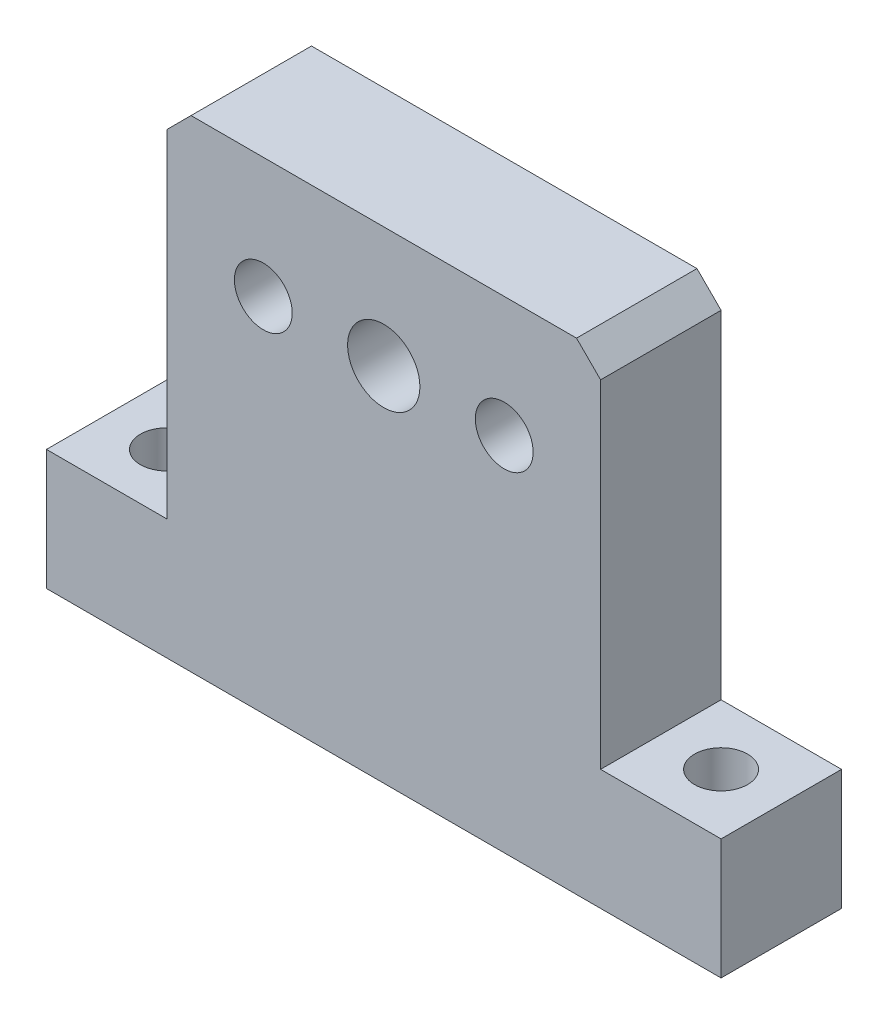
ISO-10303-21;
HEADER;
FILE_DESCRIPTION(('STEP AP214'),'2;1');
FILE_NAME('part.step','',(''),(''),'','','');
FILE_SCHEMA(('AUTOMOTIVE_DESIGN { 1 0 10303 214 1 1 1 1 }'));
ENDSEC;
DATA;
#1=APPLICATION_CONTEXT('core data for automotive mechanical design processes');
#2=APPLICATION_PROTOCOL_DEFINITION('international standard','automotive_design',2000,#1);
#3=PRODUCT_CONTEXT('',#1,'mechanical');
#4=PRODUCT('Part','Part','',(#3));
#5=PRODUCT_RELATED_PRODUCT_CATEGORY('part','',(#4));
#6=PRODUCT_DEFINITION_FORMATION('','',#4);
#7=PRODUCT_DEFINITION_CONTEXT('part definition',#1,'design');
#8=PRODUCT_DEFINITION('design','',#6,#7);
#9=PRODUCT_DEFINITION_SHAPE('','',#8);
#10=(LENGTH_UNIT() NAMED_UNIT(*) SI_UNIT(.MILLI.,.METRE.));
#11=(NAMED_UNIT(*) PLANE_ANGLE_UNIT() SI_UNIT($,.RADIAN.));
#12=(NAMED_UNIT(*) SI_UNIT($,.STERADIAN.) SOLID_ANGLE_UNIT());
#13=UNCERTAINTY_MEASURE_WITH_UNIT(LENGTH_MEASURE(1.E-05),#10,'distance_accuracy_value','');
#14=(GEOMETRIC_REPRESENTATION_CONTEXT(3) GLOBAL_UNCERTAINTY_ASSIGNED_CONTEXT((#13)) GLOBAL_UNIT_ASSIGNED_CONTEXT((#10,
#11,#12)) REPRESENTATION_CONTEXT('',''));
#15=CARTESIAN_POINT('',(0.,0.,0.));
#16=DIRECTION('',(0.,0.,1.));
#17=DIRECTION('',(1.,0.,0.));
#18=AXIS2_PLACEMENT_3D('',#15,#16,#17);
#19=CARTESIAN_POINT('',(-70.,100.,25.));
#20=DIRECTION('',(1.,0.,0.));
#21=DIRECTION('',(0.,1.,0.));
#22=AXIS2_PLACEMENT_3D('',#19,#20,#21);
#23=PLANE('',#22);
#24=DIRECTION('',(0.,-1.,0.));
#25=VECTOR('',#24,1.);
#26=CARTESIAN_POINT('',(-70.,100.,25.));
#27=LINE('',#26,#25);
#28=CARTESIAN_POINT('',(-70.,25.,25.));
#29=VERTEX_POINT('',#28);
#30=CARTESIAN_POINT('',(-70.,0.,25.));
#31=VERTEX_POINT('',#30);
#32=EDGE_CURVE('E137',#29,#31,#27,.T.);
#33=ORIENTED_EDGE('',*,*,#32,.F.);
#34=DIRECTION('',(0.,0.,1.));
#35=VECTOR('',#34,1.);
#36=CARTESIAN_POINT('',(-70.,25.,0.));
#37=LINE('',#36,#35);
#38=CARTESIAN_POINT('',(-70.,25.,0.));
#39=VERTEX_POINT('',#38);
#40=EDGE_CURVE('E187',#39,#29,#37,.T.);
#41=ORIENTED_EDGE('',*,*,#40,.F.);
#42=DIRECTION('',(0.,-1.,0.));
#43=VECTOR('',#42,1.);
#44=CARTESIAN_POINT('',(-70.,100.,0.));
#45=LINE('',#44,#43);
#46=CARTESIAN_POINT('',(-70.,0.,0.));
#47=VERTEX_POINT('',#46);
#48=EDGE_CURVE('E139',#39,#47,#45,.T.);
#49=ORIENTED_EDGE('',*,*,#48,.T.);
#50=DIRECTION('',(0.,0.,-1.));
#51=VECTOR('',#50,1.);
#52=CARTESIAN_POINT('',(-70.,0.,25.));
#53=LINE('',#52,#51);
#54=EDGE_CURVE('E144',#31,#47,#53,.T.);
#55=ORIENTED_EDGE('',*,*,#54,.F.);
#56=EDGE_LOOP('',(#33,#41,#49,#55));
#57=FACE_BOUND('',#56,.T.);
#58=ADVANCED_FACE('F31',(#57),#23,.F.);
#59=CARTESIAN_POINT('',(-70.,0.,25.));
#60=DIRECTION('',(0.,1.,0.));
#61=DIRECTION('',(0.,0.,1.));
#62=AXIS2_PLACEMENT_3D('',#59,#60,#61);
#63=PLANE('',#62);
#64=CARTESIAN_POINT('',(57.5,0.,12.5));
#65=DIRECTION('',(0.,1.,0.));
#66=DIRECTION('',(0.,0.,1.));
#67=AXIS2_PLACEMENT_3D('',#64,#65,#66);
#68=CIRCLE('',#67,5.5);
#69=CARTESIAN_POINT('',(57.5,0.,18.));
#70=VERTEX_POINT('',#69);
#71=EDGE_CURVE('E268',#70,#70,#68,.T.);
#72=ORIENTED_EDGE('',*,*,#71,.T.);
#73=EDGE_LOOP('',(#72));
#74=FACE_BOUND('',#73,.T.);
#75=CARTESIAN_POINT('',(-57.5,0.,12.5));
#76=DIRECTION('',(0.,1.,0.));
#77=DIRECTION('',(0.,0.,1.));
#78=AXIS2_PLACEMENT_3D('',#75,#76,#77);
#79=CIRCLE('',#78,5.5);
#80=CARTESIAN_POINT('',(-57.5,0.,18.));
#81=VERTEX_POINT('',#80);
#82=EDGE_CURVE('E276',#81,#81,#79,.T.);
#83=ORIENTED_EDGE('',*,*,#82,.T.);
#84=EDGE_LOOP('',(#83));
#85=FACE_BOUND('',#84,.T.);
#86=DIRECTION('',(1.,0.,0.));
#87=VECTOR('',#86,1.);
#88=CARTESIAN_POINT('',(-70.,0.,0.));
#89=LINE('',#88,#87);
#90=CARTESIAN_POINT('',(70.,0.,0.));
#91=VERTEX_POINT('',#90);
#92=EDGE_CURVE('E135',#47,#91,#89,.T.);
#93=ORIENTED_EDGE('',*,*,#92,.T.);
#94=DIRECTION('',(0.,0.,-1.));
#95=VECTOR('',#94,1.);
#96=CARTESIAN_POINT('',(70.,0.,25.));
#97=LINE('',#96,#95);
#98=CARTESIAN_POINT('',(70.,0.,25.));
#99=VERTEX_POINT('',#98);
#100=EDGE_CURVE('E133',#99,#91,#97,.T.);
#101=ORIENTED_EDGE('',*,*,#100,.F.);
#102=DIRECTION('',(1.,0.,0.));
#103=VECTOR('',#102,1.);
#104=CARTESIAN_POINT('',(-70.,0.,25.));
#105=LINE('',#104,#103);
#106=EDGE_CURVE('E179',#31,#99,#105,.T.);
#107=ORIENTED_EDGE('',*,*,#106,.F.);
#108=ORIENTED_EDGE('',*,*,#54,.T.);
#109=EDGE_LOOP('',(#93,#101,#107,#108));
#110=FACE_BOUND('',#109,.T.);
#111=ADVANCED_FACE('F201',(#74,#85,#110),#63,.F.);
#112=CARTESIAN_POINT('',(70.,100.,25.));
#113=DIRECTION('',(-1.,0.,0.));
#114=DIRECTION('',(0.,-1.,0.));
#115=AXIS2_PLACEMENT_3D('',#112,#113,#114);
#116=PLANE('',#115);
#117=DIRECTION('',(0.,1.,0.));
#118=VECTOR('',#117,1.);
#119=CARTESIAN_POINT('',(70.,100.,0.));
#120=LINE('',#119,#118);
#121=CARTESIAN_POINT('',(70.,25.,0.));
#122=VERTEX_POINT('',#121);
#123=EDGE_CURVE('E126',#91,#122,#120,.T.);
#124=ORIENTED_EDGE('',*,*,#123,.T.);
#125=DIRECTION('',(0.,0.,1.));
#126=VECTOR('',#125,1.);
#127=CARTESIAN_POINT('',(70.,25.,0.));
#128=LINE('',#127,#126);
#129=CARTESIAN_POINT('',(70.,25.,25.));
#130=VERTEX_POINT('',#129);
#131=EDGE_CURVE('E108',#122,#130,#128,.T.);
#132=ORIENTED_EDGE('',*,*,#131,.T.);
#133=DIRECTION('',(0.,1.,0.));
#134=VECTOR('',#133,1.);
#135=CARTESIAN_POINT('',(70.,100.,25.));
#136=LINE('',#135,#134);
#137=EDGE_CURVE('E177',#99,#130,#136,.T.);
#138=ORIENTED_EDGE('',*,*,#137,.F.);
#139=ORIENTED_EDGE('',*,*,#100,.T.);
#140=EDGE_LOOP('',(#124,#132,#138,#139));
#141=FACE_BOUND('',#140,.T.);
#142=ADVANCED_FACE('F131',(#141),#116,.F.);
#143=CARTESIAN_POINT('',(-70.,100.,25.));
#144=DIRECTION('',(0.,-1.,0.));
#145=DIRECTION('',(0.,0.,-1.));
#146=AXIS2_PLACEMENT_3D('',#143,#144,#145);
#147=PLANE('',#146);
#148=DIRECTION('',(-1.,0.,0.));
#149=VECTOR('',#148,1.);
#150=CARTESIAN_POINT('',(-70.,100.,25.));
#151=LINE('',#150,#149);
#152=CARTESIAN_POINT('',(40.,100.,25.));
#153=VERTEX_POINT('',#152);
#154=CARTESIAN_POINT('',(-40.,100.,25.));
#155=VERTEX_POINT('',#154);
#156=EDGE_CURVE('E145',#153,#155,#151,.T.);
#157=ORIENTED_EDGE('',*,*,#156,.F.);
#158=DIRECTION('',(0.,0.,-1.));
#159=VECTOR('',#158,1.);
#160=CARTESIAN_POINT('',(40.,100.,25.));
#161=LINE('',#160,#159);
#162=CARTESIAN_POINT('',(40.,100.,0.));
#163=VERTEX_POINT('',#162);
#164=EDGE_CURVE('E158',#153,#163,#161,.T.);
#165=ORIENTED_EDGE('',*,*,#164,.T.);
#166=DIRECTION('',(-1.,0.,0.));
#167=VECTOR('',#166,1.);
#168=CARTESIAN_POINT('',(-70.,100.,0.));
#169=LINE('',#168,#167);
#170=CARTESIAN_POINT('',(-40.,100.,0.));
#171=VERTEX_POINT('',#170);
#172=EDGE_CURVE('E134',#163,#171,#169,.T.);
#173=ORIENTED_EDGE('',*,*,#172,.T.);
#174=DIRECTION('',(0.,0.,1.));
#175=VECTOR('',#174,1.);
#176=CARTESIAN_POINT('',(-40.,100.,25.));
#177=LINE('',#176,#175);
#178=EDGE_CURVE('E155',#171,#155,#177,.T.);
#179=ORIENTED_EDGE('',*,*,#178,.T.);
#180=EDGE_LOOP('',(#157,#165,#173,#179));
#181=FACE_BOUND('',#180,.T.);
#182=ADVANCED_FACE('F175',(#181),#147,.F.);
#183=CARTESIAN_POINT('',(-70.,0.,25.));
#184=DIRECTION('',(0.,0.,1.));
#185=DIRECTION('',(1.,0.,0.));
#186=AXIS2_PLACEMENT_3D('',#183,#184,#185);
#187=PLANE('',#186);
#188=CARTESIAN_POINT('',(25.,75.,25.));
#189=DIRECTION('',(0.,0.,1.));
#190=DIRECTION('',(1.,0.,0.));
#191=AXIS2_PLACEMENT_3D('',#188,#189,#190);
#192=CIRCLE('',#191,6.);
#193=CARTESIAN_POINT('',(31.,75.,25.));
#194=VERTEX_POINT('',#193);
#195=EDGE_CURVE('E279',#194,#194,#192,.T.);
#196=ORIENTED_EDGE('',*,*,#195,.F.);
#197=EDGE_LOOP('',(#196));
#198=FACE_BOUND('',#197,.T.);
#199=CARTESIAN_POINT('',(-25.,75.,25.));
#200=DIRECTION('',(0.,0.,1.));
#201=DIRECTION('',(1.,0.,0.));
#202=AXIS2_PLACEMENT_3D('',#199,#200,#201);
#203=CIRCLE('',#202,6.);
#204=CARTESIAN_POINT('',(-19.,75.,25.));
#205=VERTEX_POINT('',#204);
#206=EDGE_CURVE('E285',#205,#205,#203,.T.);
#207=ORIENTED_EDGE('',*,*,#206,.F.);
#208=EDGE_LOOP('',(#207));
#209=FACE_BOUND('',#208,.T.);
#210=CARTESIAN_POINT('',(0.,75.,25.));
#211=DIRECTION('',(0.,0.,1.));
#212=DIRECTION('',(1.,0.,0.));
#213=AXIS2_PLACEMENT_3D('',#210,#211,#212);
#214=CIRCLE('',#213,7.5);
#215=CARTESIAN_POINT('',(7.5,75.,25.));
#216=VERTEX_POINT('',#215);
#217=EDGE_CURVE('E291',#216,#216,#214,.T.);
#218=ORIENTED_EDGE('',*,*,#217,.F.);
#219=EDGE_LOOP('',(#218));
#220=FACE_BOUND('',#219,.T.);
#221=DIRECTION('',(0.,-1.,0.));
#222=VECTOR('',#221,1.);
#223=CARTESIAN_POINT('',(45.,100.,25.));
#224=LINE('',#223,#222);
#225=CARTESIAN_POINT('',(45.,95.,25.));
#226=VERTEX_POINT('',#225);
#227=CARTESIAN_POINT('',(45.,25.,25.));
#228=VERTEX_POINT('',#227);
#229=EDGE_CURVE('E173',#226,#228,#224,.T.);
#230=ORIENTED_EDGE('',*,*,#229,.F.);
#231=DIRECTION('',(0.707106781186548,-0.707106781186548,0.));
#232=VECTOR('',#231,1.);
#233=CARTESIAN_POINT('',(35.,105.,25.));
#234=LINE('',#233,#232);
#235=EDGE_CURVE('E153',#226,#153,#234,.F.);
#236=ORIENTED_EDGE('',*,*,#235,.T.);
#237=ORIENTED_EDGE('',*,*,#156,.T.);
#238=DIRECTION('',(0.707106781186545,0.70710678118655,0.));
#239=VECTOR('',#238,1.);
#240=CARTESIAN_POINT('',(-105.,34.9999999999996,25.));
#241=LINE('',#240,#239);
#242=CARTESIAN_POINT('',(-45.,95.,25.));
#243=VERTEX_POINT('',#242);
#244=EDGE_CURVE('E151',#155,#243,#241,.F.);
#245=ORIENTED_EDGE('',*,*,#244,.T.);
#246=DIRECTION('',(0.,1.,0.));
#247=VECTOR('',#246,1.);
#248=CARTESIAN_POINT('',(-45.,100.,25.));
#249=LINE('',#248,#247);
#250=CARTESIAN_POINT('',(-45.,25.,25.));
#251=VERTEX_POINT('',#250);
#252=EDGE_CURVE('E194',#251,#243,#249,.T.);
#253=ORIENTED_EDGE('',*,*,#252,.F.);
#254=DIRECTION('',(1.,0.,0.));
#255=VECTOR('',#254,1.);
#256=CARTESIAN_POINT('',(-70.,25.,25.));
#257=LINE('',#256,#255);
#258=EDGE_CURVE('E120',#29,#251,#257,.T.);
#259=ORIENTED_EDGE('',*,*,#258,.F.);
#260=ORIENTED_EDGE('',*,*,#32,.T.);
#261=ORIENTED_EDGE('',*,*,#106,.T.);
#262=ORIENTED_EDGE('',*,*,#137,.T.);
#263=DIRECTION('',(1.,0.,0.));
#264=VECTOR('',#263,1.);
#265=CARTESIAN_POINT('',(70.,25.,25.));
#266=LINE('',#265,#264);
#267=EDGE_CURVE('E115',#228,#130,#266,.T.);
#268=ORIENTED_EDGE('',*,*,#267,.F.);
#269=EDGE_LOOP('',(#230,#236,#237,#245,#253,#259,#260,#261,#262,#268));
#270=FACE_BOUND('',#269,.T.);
#271=ADVANCED_FACE('F172',(#198,#209,#220,#270),#187,.T.);
#272=CARTESIAN_POINT('',(-70.,0.,0.));
#273=DIRECTION('',(0.,0.,1.));
#274=DIRECTION('',(1.,0.,0.));
#275=AXIS2_PLACEMENT_3D('',#272,#273,#274);
#276=PLANE('',#275);
#277=CARTESIAN_POINT('',(25.,75.,0.));
#278=DIRECTION('',(0.,0.,1.));
#279=DIRECTION('',(1.,0.,0.));
#280=AXIS2_PLACEMENT_3D('',#277,#278,#279);
#281=CIRCLE('',#280,6.);
#282=CARTESIAN_POINT('',(31.,75.,0.));
#283=VERTEX_POINT('',#282);
#284=EDGE_CURVE('E282',#283,#283,#281,.T.);
#285=ORIENTED_EDGE('',*,*,#284,.T.);
#286=EDGE_LOOP('',(#285));
#287=FACE_BOUND('',#286,.T.);
#288=CARTESIAN_POINT('',(-25.,75.,0.));
#289=DIRECTION('',(0.,0.,1.));
#290=DIRECTION('',(1.,0.,0.));
#291=AXIS2_PLACEMENT_3D('',#288,#289,#290);
#292=CIRCLE('',#291,6.);
#293=CARTESIAN_POINT('',(-19.,75.,0.));
#294=VERTEX_POINT('',#293);
#295=EDGE_CURVE('E288',#294,#294,#292,.T.);
#296=ORIENTED_EDGE('',*,*,#295,.T.);
#297=EDGE_LOOP('',(#296));
#298=FACE_BOUND('',#297,.T.);
#299=CARTESIAN_POINT('',(0.,75.,0.));
#300=DIRECTION('',(0.,0.,1.));
#301=DIRECTION('',(1.,0.,0.));
#302=AXIS2_PLACEMENT_3D('',#299,#300,#301);
#303=CIRCLE('',#302,7.5);
#304=CARTESIAN_POINT('',(7.5,75.,0.));
#305=VERTEX_POINT('',#304);
#306=EDGE_CURVE('E294',#305,#305,#303,.T.);
#307=ORIENTED_EDGE('',*,*,#306,.T.);
#308=EDGE_LOOP('',(#307));
#309=FACE_BOUND('',#308,.T.);
#310=ORIENTED_EDGE('',*,*,#172,.F.);
#311=DIRECTION('',(-0.707106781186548,0.707106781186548,0.));
#312=VECTOR('',#311,1.);
#313=CARTESIAN_POINT('',(45.,95.,0.));
#314=LINE('',#313,#312);
#315=CARTESIAN_POINT('',(45.,95.,0.));
#316=VERTEX_POINT('',#315);
#317=EDGE_CURVE('E39',#163,#316,#314,.F.);
#318=ORIENTED_EDGE('',*,*,#317,.T.);
#319=DIRECTION('',(0.,-1.,0.));
#320=VECTOR('',#319,1.);
#321=CARTESIAN_POINT('',(45.,100.,0.));
#322=LINE('',#321,#320);
#323=CARTESIAN_POINT('',(45.,25.,0.));
#324=VERTEX_POINT('',#323);
#325=EDGE_CURVE('E128',#316,#324,#322,.T.);
#326=ORIENTED_EDGE('',*,*,#325,.T.);
#327=DIRECTION('',(1.,0.,0.));
#328=VECTOR('',#327,1.);
#329=CARTESIAN_POINT('',(70.,25.,0.));
#330=LINE('',#329,#328);
#331=EDGE_CURVE('E112',#324,#122,#330,.T.);
#332=ORIENTED_EDGE('',*,*,#331,.T.);
#333=ORIENTED_EDGE('',*,*,#123,.F.);
#334=ORIENTED_EDGE('',*,*,#92,.F.);
#335=ORIENTED_EDGE('',*,*,#48,.F.);
#336=DIRECTION('',(1.,0.,0.));
#337=VECTOR('',#336,1.);
#338=CARTESIAN_POINT('',(-70.,25.,0.));
#339=LINE('',#338,#337);
#340=CARTESIAN_POINT('',(-45.,25.,0.));
#341=VERTEX_POINT('',#340);
#342=EDGE_CURVE('E203',#39,#341,#339,.T.);
#343=ORIENTED_EDGE('',*,*,#342,.T.);
#344=DIRECTION('',(0.,1.,0.));
#345=VECTOR('',#344,1.);
#346=CARTESIAN_POINT('',(-45.,100.,0.));
#347=LINE('',#346,#345);
#348=CARTESIAN_POINT('',(-45.,95.,0.));
#349=VERTEX_POINT('',#348);
#350=EDGE_CURVE('E191',#341,#349,#347,.T.);
#351=ORIENTED_EDGE('',*,*,#350,.T.);
#352=DIRECTION('',(-0.707106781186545,-0.70710678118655,0.));
#353=VECTOR('',#352,1.);
#354=CARTESIAN_POINT('',(-40.,100.,0.));
#355=LINE('',#354,#353);
#356=EDGE_CURVE('E51',#349,#171,#355,.F.);
#357=ORIENTED_EDGE('',*,*,#356,.T.);
#358=EDGE_LOOP('',(#310,#318,#326,#332,#333,#334,#335,#343,#351,#357));
#359=FACE_BOUND('',#358,.T.);
#360=ADVANCED_FACE('F124',(#287,#298,#309,#359),#276,.F.);
#361=CARTESIAN_POINT('',(-45.,100.,0.));
#362=DIRECTION('',(1.,0.,0.));
#363=DIRECTION('',(0.,1.,0.));
#364=AXIS2_PLACEMENT_3D('',#361,#362,#363);
#365=PLANE('',#364);
#366=ORIENTED_EDGE('',*,*,#252,.T.);
#367=DIRECTION('',(0.,0.,-1.));
#368=VECTOR('',#367,1.);
#369=CARTESIAN_POINT('',(-45.,95.,0.));
#370=LINE('',#369,#368);
#371=EDGE_CURVE('E11',#243,#349,#370,.T.);
#372=ORIENTED_EDGE('',*,*,#371,.T.);
#373=ORIENTED_EDGE('',*,*,#350,.F.);
#374=DIRECTION('',(0.,0.,1.));
#375=VECTOR('',#374,1.);
#376=CARTESIAN_POINT('',(-45.,25.,0.));
#377=LINE('',#376,#375);
#378=EDGE_CURVE('E182',#341,#251,#377,.T.);
#379=ORIENTED_EDGE('',*,*,#378,.T.);
#380=EDGE_LOOP('',(#366,#372,#373,#379));
#381=FACE_BOUND('',#380,.T.);
#382=ADVANCED_FACE('F210',(#381),#365,.F.);
#383=CARTESIAN_POINT('',(-70.,25.,0.));
#384=DIRECTION('',(0.,-1.,0.));
#385=DIRECTION('',(0.,0.,-1.));
#386=AXIS2_PLACEMENT_3D('',#383,#384,#385);
#387=PLANE('',#386);
#388=CARTESIAN_POINT('',(-57.5,25.,12.5));
#389=DIRECTION('',(0.,1.,0.));
#390=DIRECTION('',(0.,0.,1.));
#391=AXIS2_PLACEMENT_3D('',#388,#389,#390);
#392=CIRCLE('',#391,5.5);
#393=CARTESIAN_POINT('',(-57.5,25.,18.));
#394=VERTEX_POINT('',#393);
#395=EDGE_CURVE('E273',#394,#394,#392,.T.);
#396=ORIENTED_EDGE('',*,*,#395,.F.);
#397=EDGE_LOOP('',(#396));
#398=FACE_BOUND('',#397,.T.);
#399=ORIENTED_EDGE('',*,*,#258,.T.);
#400=ORIENTED_EDGE('',*,*,#378,.F.);
#401=ORIENTED_EDGE('',*,*,#342,.F.);
#402=ORIENTED_EDGE('',*,*,#40,.T.);
#403=EDGE_LOOP('',(#399,#400,#401,#402));
#404=FACE_BOUND('',#403,.T.);
#405=ADVANCED_FACE('F209',(#398,#404),#387,.F.);
#406=CARTESIAN_POINT('',(70.,25.,0.));
#407=DIRECTION('',(0.,-1.,0.));
#408=DIRECTION('',(0.,0.,-1.));
#409=AXIS2_PLACEMENT_3D('',#406,#407,#408);
#410=PLANE('',#409);
#411=CARTESIAN_POINT('',(57.5,25.,12.5));
#412=DIRECTION('',(0.,1.,0.));
#413=DIRECTION('',(0.,0.,1.));
#414=AXIS2_PLACEMENT_3D('',#411,#412,#413);
#415=CIRCLE('',#414,5.5);
#416=CARTESIAN_POINT('',(57.5,25.,18.));
#417=VERTEX_POINT('',#416);
#418=EDGE_CURVE('E271',#417,#417,#415,.T.);
#419=ORIENTED_EDGE('',*,*,#418,.F.);
#420=EDGE_LOOP('',(#419));
#421=FACE_BOUND('',#420,.T.);
#422=ORIENTED_EDGE('',*,*,#267,.T.);
#423=ORIENTED_EDGE('',*,*,#131,.F.);
#424=ORIENTED_EDGE('',*,*,#331,.F.);
#425=DIRECTION('',(0.,0.,1.));
#426=VECTOR('',#425,1.);
#427=CARTESIAN_POINT('',(45.,25.,0.));
#428=LINE('',#427,#426);
#429=EDGE_CURVE('E121',#324,#228,#428,.T.);
#430=ORIENTED_EDGE('',*,*,#429,.T.);
#431=EDGE_LOOP('',(#422,#423,#424,#430));
#432=FACE_BOUND('',#431,.T.);
#433=ADVANCED_FACE('F110',(#421,#432),#410,.F.);
#434=CARTESIAN_POINT('',(45.,100.,0.));
#435=DIRECTION('',(-1.,0.,0.));
#436=DIRECTION('',(0.,-1.,0.));
#437=AXIS2_PLACEMENT_3D('',#434,#435,#436);
#438=PLANE('',#437);
#439=ORIENTED_EDGE('',*,*,#325,.F.);
#440=DIRECTION('',(0.,0.,1.));
#441=VECTOR('',#440,1.);
#442=CARTESIAN_POINT('',(45.,95.,0.));
#443=LINE('',#442,#441);
#444=EDGE_CURVE('E148',#316,#226,#443,.T.);
#445=ORIENTED_EDGE('',*,*,#444,.T.);
#446=ORIENTED_EDGE('',*,*,#229,.T.);
#447=ORIENTED_EDGE('',*,*,#429,.F.);
#448=EDGE_LOOP('',(#439,#445,#446,#447));
#449=FACE_BOUND('',#448,.T.);
#450=ADVANCED_FACE('F165',(#449),#438,.F.);
#451=CARTESIAN_POINT('',(0.,75.,0.));
#452=DIRECTION('',(0.,0.,1.));
#453=DIRECTION('',(1.,0.,0.));
#454=AXIS2_PLACEMENT_3D('',#451,#452,#453);
#455=CYLINDRICAL_SURFACE('',#454,7.5);
#456=ORIENTED_EDGE('',*,*,#306,.F.);
#457=EDGE_LOOP('',(#456));
#458=FACE_BOUND('',#457,.T.);
#459=ORIENTED_EDGE('',*,*,#217,.T.);
#460=EDGE_LOOP('',(#459));
#461=FACE_BOUND('',#460,.T.);
#462=ADVANCED_FACE('F242',(#458,#461),#455,.F.);
#463=CARTESIAN_POINT('',(-25.,75.,0.));
#464=DIRECTION('',(0.,0.,1.));
#465=DIRECTION('',(1.,0.,0.));
#466=AXIS2_PLACEMENT_3D('',#463,#464,#465);
#467=CYLINDRICAL_SURFACE('',#466,6.);
#468=ORIENTED_EDGE('',*,*,#295,.F.);
#469=EDGE_LOOP('',(#468));
#470=FACE_BOUND('',#469,.T.);
#471=ORIENTED_EDGE('',*,*,#206,.T.);
#472=EDGE_LOOP('',(#471));
#473=FACE_BOUND('',#472,.T.);
#474=ADVANCED_FACE('F248',(#470,#473),#467,.F.);
#475=CARTESIAN_POINT('',(25.,75.,0.));
#476=DIRECTION('',(0.,0.,1.));
#477=DIRECTION('',(1.,0.,0.));
#478=AXIS2_PLACEMENT_3D('',#475,#476,#477);
#479=CYLINDRICAL_SURFACE('',#478,6.);
#480=ORIENTED_EDGE('',*,*,#284,.F.);
#481=EDGE_LOOP('',(#480));
#482=FACE_BOUND('',#481,.T.);
#483=ORIENTED_EDGE('',*,*,#195,.T.);
#484=EDGE_LOOP('',(#483));
#485=FACE_BOUND('',#484,.T.);
#486=ADVANCED_FACE('F252',(#482,#485),#479,.F.);
#487=CARTESIAN_POINT('',(-57.5,0.,12.5));
#488=DIRECTION('',(0.,1.,0.));
#489=DIRECTION('',(0.,0.,1.));
#490=AXIS2_PLACEMENT_3D('',#487,#488,#489);
#491=CYLINDRICAL_SURFACE('',#490,5.5);
#492=ORIENTED_EDGE('',*,*,#82,.F.);
#493=EDGE_LOOP('',(#492));
#494=FACE_BOUND('',#493,.T.);
#495=ORIENTED_EDGE('',*,*,#395,.T.);
#496=EDGE_LOOP('',(#495));
#497=FACE_BOUND('',#496,.T.);
#498=ADVANCED_FACE('F256',(#494,#497),#491,.F.);
#499=CARTESIAN_POINT('',(57.5,0.,12.5));
#500=DIRECTION('',(0.,1.,0.));
#501=DIRECTION('',(0.,0.,1.));
#502=AXIS2_PLACEMENT_3D('',#499,#500,#501);
#503=CYLINDRICAL_SURFACE('',#502,5.5);
#504=ORIENTED_EDGE('',*,*,#71,.F.);
#505=EDGE_LOOP('',(#504));
#506=FACE_BOUND('',#505,.T.);
#507=ORIENTED_EDGE('',*,*,#418,.T.);
#508=EDGE_LOOP('',(#507));
#509=FACE_BOUND('',#508,.T.);
#510=ADVANCED_FACE('F216',(#506,#509),#503,.F.);
#511=CARTESIAN_POINT('',(45.,95.,0.));
#512=DIRECTION('',(-0.707106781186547,-0.707106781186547,0.));
#513=DIRECTION('',(0.707106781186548,-0.707106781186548,0.));
#514=AXIS2_PLACEMENT_3D('',#511,#512,#513);
#515=PLANE('',#514);
#516=ORIENTED_EDGE('',*,*,#317,.F.);
#517=ORIENTED_EDGE('',*,*,#164,.F.);
#518=ORIENTED_EDGE('',*,*,#235,.F.);
#519=ORIENTED_EDGE('',*,*,#444,.F.);
#520=EDGE_LOOP('',(#516,#517,#518,#519));
#521=FACE_BOUND('',#520,.T.);
#522=ADVANCED_FACE('F168',(#521),#515,.F.);
#523=CARTESIAN_POINT('',(-40.,100.,25.));
#524=DIRECTION('',(0.70710678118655,-0.707106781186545,0.));
#525=DIRECTION('',(0.707106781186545,0.70710678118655,0.));
#526=AXIS2_PLACEMENT_3D('',#523,#524,#525);
#527=PLANE('',#526);
#528=ORIENTED_EDGE('',*,*,#356,.F.);
#529=ORIENTED_EDGE('',*,*,#371,.F.);
#530=ORIENTED_EDGE('',*,*,#244,.F.);
#531=ORIENTED_EDGE('',*,*,#178,.F.);
#532=EDGE_LOOP('',(#528,#529,#530,#531));
#533=FACE_BOUND('',#532,.T.);
#534=ADVANCED_FACE('F33',(#533),#527,.F.);
#535=CLOSED_SHELL('',(#58,#111,#142,#182,#271,#360,#382,#405,#433,#450,#462,#474,#486,#498,#510,
#522,#534));
#536=MANIFOLD_SOLID_BREP('B2',#535);
#537=ADVANCED_BREP_SHAPE_REPRESENTATION('',(#18,#536),#14);
#538=SHAPE_DEFINITION_REPRESENTATION(#9,#537);
ENDSEC;
END-ISO-10303-21;
